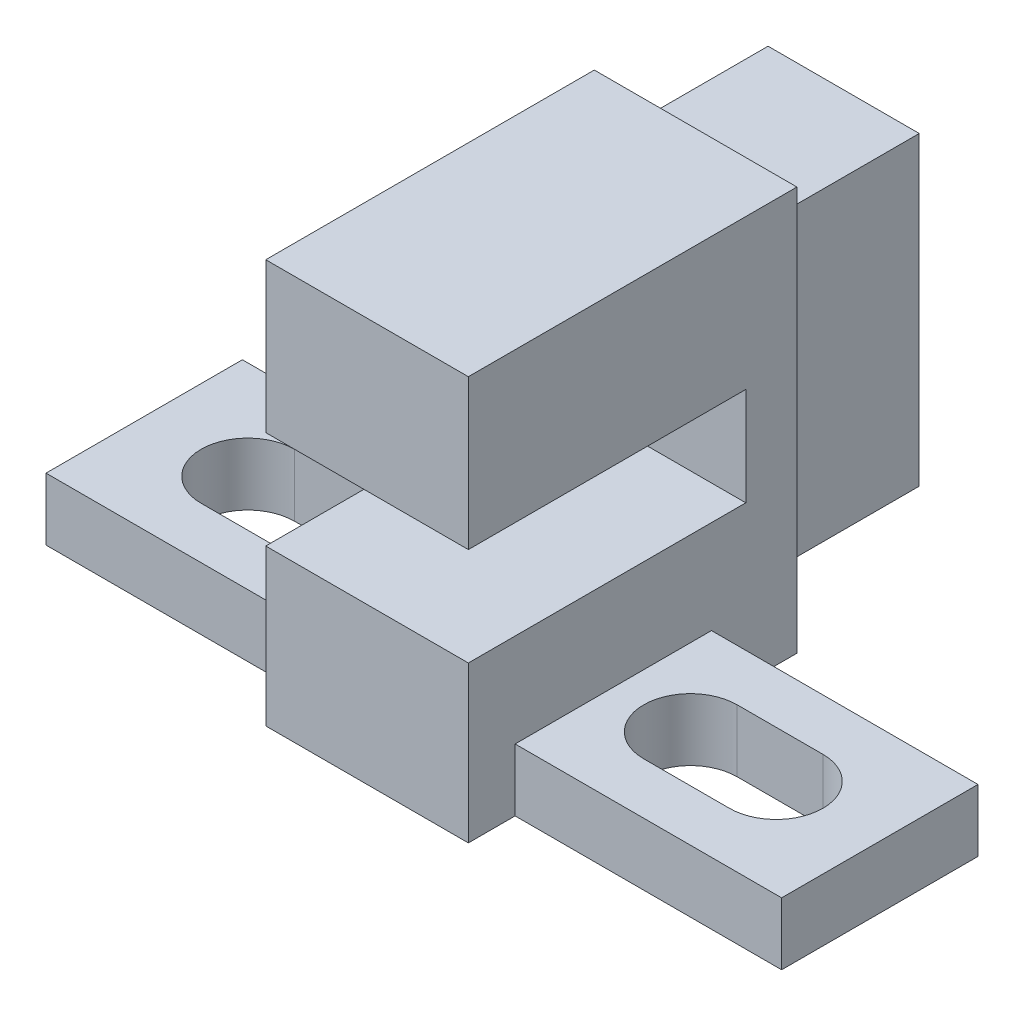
from build123d import *

# Parameters (mm, degrees)
SKETCH1_W           = 10.54
SKETCH1_H           = 12.954
BOSS_EXTRUDE1_DEPTH = 3.25
SKETCH2_W           = 8.9
SKETCH2_H           = 3.15
CUT_EXTRUDE1_DEPTH  = 18.920594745
SKETCH3_W           = 23.6
SKETCH3_H           = 6.3
BOSS_EXTRUDE2_DEPTH = 2
CUT_EXTRUDE2_DEPTH  = 21.448415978
SKETCH5_W           = 4.85
SKETCH5_H           = 9.8
BOSS_EXTRUDE3_DEPTH = 4.75


with BuildPart() as part:
    # Sketch1 → Boss-Extrude1 (new, symmetric)
    with BuildSketch(Plane(origin=(0, 0, 0), x_dir=(0, 0, -1), z_dir=(1, 0, 0))):
        with Locations((5.27, 6.477)):
            Rectangle(SKETCH1_W, SKETCH1_H)
    extrude(amount=BOSS_EXTRUDE1_DEPTH, both=True)

    # Sketch2 → Cut-Extrude1 (cut, through all)
    with BuildSketch(Plane(origin=(3.25, 0, 0), x_dir=(0, 0, -1), z_dir=(1, 0, 0))):
        with Locations((4.45, 6.575)):
            Rectangle(SKETCH2_W, SKETCH2_H)
    extrude(amount=-CUT_EXTRUDE1_DEPTH, mode=Mode.SUBTRACT)

    # Sketch3 → Boss-Extrude2 (add)
    with BuildSketch(Plane.XZ):
        with Locations((0, -4.65)):
            Rectangle(SKETCH3_W, SKETCH3_H)
    extrude(amount=-BOSS_EXTRUDE2_DEPTH)

    # Sketch4 → Cut-Extrude2 (cut, through all)
    with BuildSketch(Plane.XZ):
        with BuildLine():
            Line((-8.475, -3.15), (-5.725, -3.15))
            ThreePointArc((-5.725, -3.15), (-4.225, -4.65), (-5.725, -6.15))
            Line((-5.725, -6.15), (-8.475, -6.15))
            ThreePointArc((-8.475, -6.15), (-9.975, -4.65), (-8.475, -3.15))
        make_face()
        with BuildLine():
            Line((5.725, -3.15), (8.475, -3.15))
            ThreePointArc((8.475, -3.15), (9.975, -4.65), (8.475, -6.15))
            Line((8.475, -6.15), (5.725, -6.15))
            ThreePointArc((5.725, -6.15), (4.225, -4.65), (5.725, -3.15))
        make_face()
    extrude(amount=-CUT_EXTRUDE2_DEPTH, mode=Mode.SUBTRACT)

    # Sketch5 → Boss-Extrude3 (add)
    with BuildSketch(Plane(origin=(0, 0, -10.54), x_dir=(-1, 0, 0), z_dir=(0, 0, -1))):
        with Locations((0, 6.754)):
            Rectangle(SKETCH5_W, SKETCH5_H)
    extrude(amount=BOSS_EXTRUDE3_DEPTH)


solid = part.part
